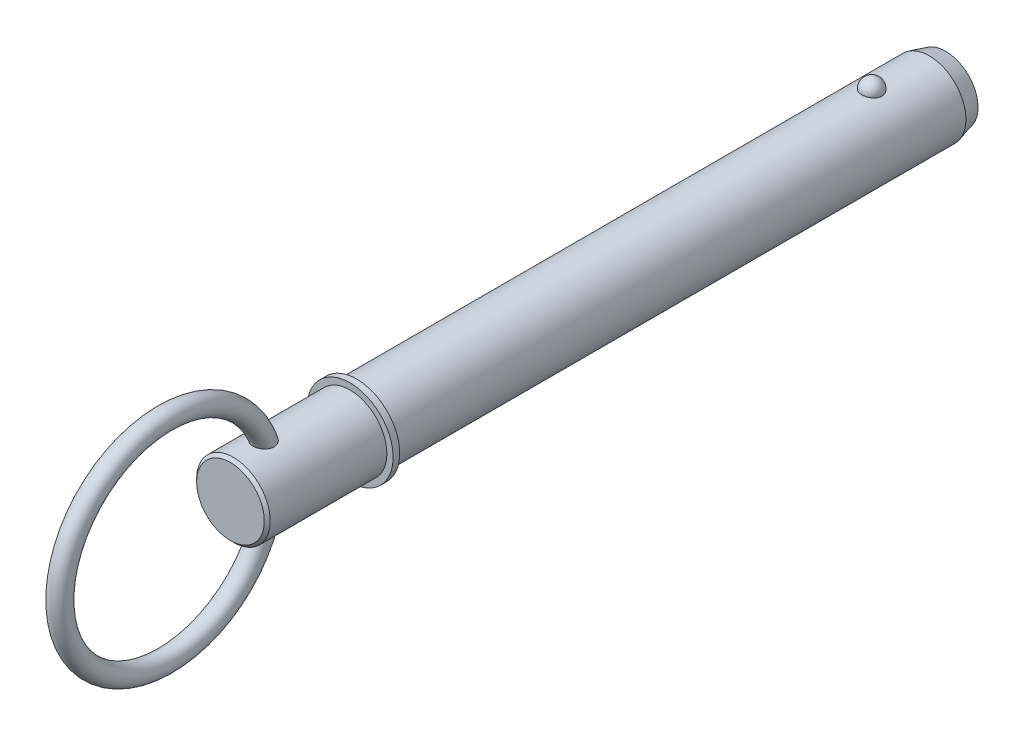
ISO-10303-21;
HEADER;
FILE_DESCRIPTION(('STEP AP214'),'2;1');
FILE_NAME('part.step','',(''),(''),'','','');
FILE_SCHEMA(('AUTOMOTIVE_DESIGN { 1 0 10303 214 1 1 1 1 }'));
ENDSEC;
DATA;
#1=APPLICATION_CONTEXT('core data for automotive mechanical design processes');
#2=APPLICATION_PROTOCOL_DEFINITION('international standard','automotive_design',2000,#1);
#3=PRODUCT_CONTEXT('',#1,'mechanical');
#4=PRODUCT('Part','Part','',(#3));
#5=PRODUCT_RELATED_PRODUCT_CATEGORY('part','',(#4));
#6=PRODUCT_DEFINITION_FORMATION('','',#4);
#7=PRODUCT_DEFINITION_CONTEXT('part definition',#1,'design');
#8=PRODUCT_DEFINITION('design','',#6,#7);
#9=PRODUCT_DEFINITION_SHAPE('','',#8);
#10=(LENGTH_UNIT() NAMED_UNIT(*) SI_UNIT(.MILLI.,.METRE.));
#11=(NAMED_UNIT(*) PLANE_ANGLE_UNIT() SI_UNIT($,.RADIAN.));
#12=(NAMED_UNIT(*) SI_UNIT($,.STERADIAN.) SOLID_ANGLE_UNIT());
#13=UNCERTAINTY_MEASURE_WITH_UNIT(LENGTH_MEASURE(1.E-05),#10,'distance_accuracy_value','');
#14=(GEOMETRIC_REPRESENTATION_CONTEXT(3) GLOBAL_UNCERTAINTY_ASSIGNED_CONTEXT((#13)) GLOBAL_UNIT_ASSIGNED_CONTEXT((#10,
#11,#12)) REPRESENTATION_CONTEXT('',''));
#15=CARTESIAN_POINT('',(0.,0.,0.));
#16=DIRECTION('',(0.,0.,1.));
#17=DIRECTION('',(1.,0.,0.));
#18=AXIS2_PLACEMENT_3D('',#15,#16,#17);
#19=CARTESIAN_POINT('',(0.,0.,152.4));
#20=DIRECTION('',(0.,0.,-1.));
#21=DIRECTION('',(-1.,0.,0.));
#22=AXIS2_PLACEMENT_3D('',#19,#20,#21);
#23=CYLINDRICAL_SURFACE('',#22,11.115);
#24=CARTESIAN_POINT('',(3.04058343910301,10.6910278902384,-3.07));
#25=CARTESIAN_POINT('',(3.04058039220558,10.6910304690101,-2.89837124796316));
#26=CARTESIAN_POINT('',(3.02657193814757,10.6950430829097,-2.72670368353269));
#27=CARTESIAN_POINT('',(2.97087341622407,10.7106465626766,-2.38822964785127));
#28=CARTESIAN_POINT('',(2.92917240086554,10.7222404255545,-2.22142512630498));
#29=CARTESIAN_POINT('',(2.81915317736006,10.751689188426,-1.89750816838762));
#30=CARTESIAN_POINT('',(2.75084669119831,10.7695413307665,-1.7403914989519));
#31=CARTESIAN_POINT('',(2.58932284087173,10.809510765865,-1.44013959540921));
#32=CARTESIAN_POINT('',(2.49610617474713,10.8316279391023,-1.29700396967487));
#33=CARTESIAN_POINT('',(2.28659317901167,10.877786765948,-1.02797591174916));
#34=CARTESIAN_POINT('',(2.17018825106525,10.9018371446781,-0.902169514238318));
#35=CARTESIAN_POINT('',(1.91759004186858,10.9490888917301,-0.672091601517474));
#36=CARTESIAN_POINT('',(1.78139672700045,10.9722902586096,-0.56782012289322));
#37=CARTESIAN_POINT('',(1.49327884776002,11.0151925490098,-0.383992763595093));
#38=CARTESIAN_POINT('',(1.34139928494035,11.034903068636,-0.304368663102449));
#39=CARTESIAN_POINT('',(1.02584823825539,11.0686948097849,-0.171731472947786));
#40=CARTESIAN_POINT('',(0.862178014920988,11.0827766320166,-0.11871554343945));
#41=CARTESIAN_POINT('',(0.530748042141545,11.1035404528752,-0.0415304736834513));
#42=CARTESIAN_POINT('',(0.363109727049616,11.1103474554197,-0.0168734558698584));
#43=CARTESIAN_POINT('',(0.025932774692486,11.1162480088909,0.0045348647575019));
#44=CARTESIAN_POINT('',(-0.143605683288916,11.1153422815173,0.0012887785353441));
#45=CARTESIAN_POINT('',(-0.477280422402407,11.1059854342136,-0.0327676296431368));
#46=CARTESIAN_POINT('',(-0.641459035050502,11.0976393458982,-0.0631942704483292));
#47=CARTESIAN_POINT('',(-0.962236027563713,11.0744390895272,-0.150220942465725));
#48=CARTESIAN_POINT('',(-1.11883427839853,11.0595848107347,-0.206821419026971));
#49=CARTESIAN_POINT('',(-1.4210461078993,11.0248420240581,-0.345028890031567));
#50=CARTESIAN_POINT('',(-1.56659244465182,11.0049254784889,-0.426775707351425));
#51=CARTESIAN_POINT('',(-1.8418931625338,10.9622119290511,-0.612956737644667));
#52=CARTESIAN_POINT('',(-1.97164597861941,10.9394146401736,-0.717393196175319));
#53=CARTESIAN_POINT('',(-2.21432263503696,10.8929139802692,-0.94833213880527));
#54=CARTESIAN_POINT('',(-2.32688909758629,10.8692016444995,-1.07520847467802));
#55=CARTESIAN_POINT('',(-2.52940007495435,10.8238699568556,-1.34622145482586));
#56=CARTESIAN_POINT('',(-2.6193430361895,10.8022507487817,-1.4903592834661));
#57=CARTESIAN_POINT('',(-2.77523958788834,10.7632629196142,-1.7936750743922));
#58=CARTESIAN_POINT('',(-2.8409151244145,10.7459442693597,-1.95300253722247));
#59=CARTESIAN_POINT('',(-2.94519180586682,10.7178360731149,-2.28083009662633));
#60=CARTESIAN_POINT('',(-2.98379371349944,10.707046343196,-2.44932993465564));
#61=CARTESIAN_POINT('',(-3.03284665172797,10.6932559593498,-2.78998091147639));
#62=CARTESIAN_POINT('',(-3.04341313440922,10.6902233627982,-2.96211412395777));
#63=CARTESIAN_POINT('',(-3.03646037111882,10.6922002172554,-3.305762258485));
#64=CARTESIAN_POINT('',(-3.0189418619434,10.6972094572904,-3.47727719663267));
#65=CARTESIAN_POINT('',(-2.95641582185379,10.7146564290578,-3.81396465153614));
#66=CARTESIAN_POINT('',(-2.91154117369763,10.7270582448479,-3.97916375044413));
#67=CARTESIAN_POINT('',(-2.79553341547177,10.7578713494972,-4.29947360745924));
#68=CARTESIAN_POINT('',(-2.72439927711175,10.7762828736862,-4.45458397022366));
#69=CARTESIAN_POINT('',(-2.55718900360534,10.8171819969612,-4.75123550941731));
#70=CARTESIAN_POINT('',(-2.46098224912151,10.8396907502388,-4.89270014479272));
#71=CARTESIAN_POINT('',(-2.24623042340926,10.8862165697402,-5.15724095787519));
#72=CARTESIAN_POINT('',(-2.12768452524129,10.9102336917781,-5.28031645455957));
#73=CARTESIAN_POINT('',(-1.87085107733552,10.9571990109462,-5.5050961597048));
#74=CARTESIAN_POINT('',(-1.73249451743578,10.9801430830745,-5.60672245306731));
#75=CARTESIAN_POINT('',(-1.44010079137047,11.0223008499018,-5.78517789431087));
#76=CARTESIAN_POINT('',(-1.28606470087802,11.0415148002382,-5.86200874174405));
#77=CARTESIAN_POINT('',(-0.968615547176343,11.0738491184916,-5.98788441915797));
#78=CARTESIAN_POINT('',(-0.805339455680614,11.0870408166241,-6.03725610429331));
#79=CARTESIAN_POINT('',(-0.47244987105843,11.1062048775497,-6.10820004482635));
#80=CARTESIAN_POINT('',(-0.302837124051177,11.11217808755,-6.1297755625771));
#81=CARTESIAN_POINT('',(0.0345765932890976,11.1162034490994,-6.14436196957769));
#82=CARTESIAN_POINT('',(0.202353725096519,11.1143988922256,-6.13788957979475));
#83=CARTESIAN_POINT('',(0.534364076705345,11.103390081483,-6.09773981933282));
#84=CARTESIAN_POINT('',(0.698597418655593,11.094186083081,-6.06406338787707));
#85=CARTESIAN_POINT('',(1.01830314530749,11.0694136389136,-5.97063285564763));
#86=CARTESIAN_POINT('',(1.17380497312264,11.0538682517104,-5.91097318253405));
#87=CARTESIAN_POINT('',(1.472484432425,11.0180608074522,-5.76723645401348));
#88=CARTESIAN_POINT('',(1.6156613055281,10.9977984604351,-5.68315789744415));
#89=CARTESIAN_POINT('',(1.88801614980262,10.9543574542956,-5.49138807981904));
#90=CARTESIAN_POINT('',(2.01695079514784,10.9311394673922,-5.38336024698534));
#91=CARTESIAN_POINT('',(2.25501495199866,10.8845248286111,-5.14733839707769));
#92=CARTESIAN_POINT('',(2.36414099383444,10.8611281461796,-5.01934088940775));
#93=CARTESIAN_POINT('',(2.56152595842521,10.8162958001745,-4.74447932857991));
#94=CARTESIAN_POINT('',(2.64940088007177,10.7948999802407,-4.59733288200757));
#95=CARTESIAN_POINT('',(2.79961494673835,10.7569242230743,-4.29001203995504));
#96=CARTESIAN_POINT('',(2.86196390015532,10.7403424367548,-4.12984267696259));
#97=CARTESIAN_POINT('',(2.95377333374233,10.715429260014,-3.820623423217));
#98=CARTESIAN_POINT('',(2.98627018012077,10.7063495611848,-3.6725268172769));
#99=CARTESIAN_POINT('',(3.02967634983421,10.6941478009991,-3.37296350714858));
#100=CARTESIAN_POINT('',(3.04058612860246,10.6910256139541,-3.2214968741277));
#101=CARTESIAN_POINT('',(3.04058343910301,10.6910278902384,-3.07));
#102=B_SPLINE_CURVE_WITH_KNOTS('',3,(#24,#25,#26,#27,#28,#29,#30,#31,#32,#33,#34,#35,#36,#37,
#38,#39,#40,#41,#42,#43,#44,#45,#46,#47,#48,#49,#50,#51,#52,#53,#54,#55,#56,#57,#58,#59,#60,#61,
#62,#63,#64,#65,#66,#67,#68,#69,#70,#71,#72,#73,#74,#75,#76,#77,#78,#79,#80,#81,#82,#83,#84,#85,
#86,#87,#88,#89,#90,#91,#92,#93,#94,#95,#96,#97,#98,#99,#100,#101),.UNSPECIFIED.,.T.,.F.,(4,2,2,
2,2,2,2,2,2,2,2,2,2,2,2,2,2,2,2,2,2,2,2,2,2,2,2,2,2,2,2,2,2,2,2,2,2,2,4),(0.,0.514341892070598,
1.02888723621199,1.54320613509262,2.0575106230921,2.57428293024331,3.09105611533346,
3.60638589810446,4.1216606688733,4.62793159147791,5.13415514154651,5.63334381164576,
6.13254097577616,6.63456562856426,7.13663998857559,7.64804063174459,8.15947638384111,
8.67660265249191,9.19371435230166,9.70869321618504,10.223658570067,10.7361421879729,
11.2486458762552,11.7638748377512,12.2791228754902,12.7962115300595,13.3132647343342,
13.8240238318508,14.3347229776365,14.8360540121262,15.3373677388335,15.8368746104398,
16.3364121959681,16.8434736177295,17.3506237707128,17.8663484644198,18.3818748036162,
18.8358944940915,19.2899046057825),.UNSPECIFIED.);
#103=CARTESIAN_POINT('',(3.04058343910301,10.6910278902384,-3.07));
#104=VERTEX_POINT('',#103);
#105=EDGE_CURVE('E100',#104,#104,#102,.T.);
#106=ORIENTED_EDGE('',*,*,#105,.T.);
#107=EDGE_LOOP('',(#106));
#108=FACE_BOUND('',#107,.T.);
#109=CARTESIAN_POINT('',(0.,0.,-20.4000000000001));
#110=DIRECTION('',(0.,0.,-1.));
#111=DIRECTION('',(-1.,0.,0.));
#112=AXIS2_PLACEMENT_3D('',#109,#110,#111);
#113=CIRCLE('',#112,11.115);
#114=CARTESIAN_POINT('',(-11.115,0.,-20.4000000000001));
#115=VERTEX_POINT('',#114);
#116=EDGE_CURVE('E108',#115,#115,#113,.F.);
#117=ORIENTED_EDGE('',*,*,#116,.T.);
#118=EDGE_LOOP('',(#117));
#119=FACE_BOUND('',#118,.T.);
#120=CARTESIAN_POINT('',(0.,0.,152.4));
#121=DIRECTION('',(0.,0.,1.));
#122=DIRECTION('',(1.,0.,0.));
#123=AXIS2_PLACEMENT_3D('',#120,#121,#122);
#124=CIRCLE('',#123,11.115);
#125=CARTESIAN_POINT('',(11.115,0.,152.4));
#126=VERTEX_POINT('',#125);
#127=EDGE_CURVE('E106',#126,#126,#124,.T.);
#128=ORIENTED_EDGE('',*,*,#127,.F.);
#129=EDGE_LOOP('',(#128));
#130=FACE_BOUND('',#129,.T.);
#131=ADVANCED_FACE('F39',(#108,#119,#130),#23,.T.);
#132=CARTESIAN_POINT('',(0.,0.,-25.4));
#133=DIRECTION('',(0.,0.,-1.));
#134=DIRECTION('',(-1.,0.,0.));
#135=AXIS2_PLACEMENT_3D('',#132,#133,#134);
#136=PLANE('',#135);
#137=CARTESIAN_POINT('',(0.,0.,-25.4));
#138=DIRECTION('',(0.,0.,-1.));
#139=DIRECTION('',(-1.,0.,0.));
#140=AXIS2_PLACEMENT_3D('',#137,#138,#139);
#141=CIRCLE('',#140,9.77525403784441);
#142=CARTESIAN_POINT('',(-9.77525403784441,0.,-25.4));
#143=VERTEX_POINT('',#142);
#144=EDGE_CURVE('E140',#143,#143,#141,.T.);
#145=ORIENTED_EDGE('',*,*,#144,.T.);
#146=EDGE_LOOP('',(#145));
#147=FACE_BOUND('',#146,.T.);
#148=ADVANCED_FACE('F86',(#147),#136,.T.);
#149=CARTESIAN_POINT('',(0.,0.,-25.4));
#150=DIRECTION('',(0.,0.,1.));
#151=DIRECTION('',(1.,0.,0.));
#152=AXIS2_PLACEMENT_3D('',#149,#150,#151);
#153=CONICAL_SURFACE('',#152,9.7752540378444,0.261799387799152);
#154=ORIENTED_EDGE('',*,*,#116,.F.);
#155=EDGE_LOOP('',(#154));
#156=FACE_BOUND('',#155,.T.);
#157=ORIENTED_EDGE('',*,*,#144,.F.);
#158=EDGE_LOOP('',(#157));
#159=FACE_BOUND('',#158,.T.);
#160=ADVANCED_FACE('F92',(#156,#159),#153,.T.);
#161=CARTESIAN_POINT('',(0.,11.115,-3.07));
#162=DIRECTION('',(0.,1.,0.));
#163=DIRECTION('',(0.,0.,1.));
#164=AXIS2_PLACEMENT_3D('',#161,#162,#163);
#165=SPHERICAL_SURFACE('',#164,3.07);
#166=ORIENTED_EDGE('',*,*,#105,.F.);
#167=EDGE_LOOP('',(#166));
#168=FACE_BOUND('',#167,.T.);
#169=ADVANCED_FACE('F111',(#168),#165,.T.);
#170=CARTESIAN_POINT('',(0.,0.,152.4));
#171=DIRECTION('',(0.,0.,-1.));
#172=DIRECTION('',(-1.,0.,0.));
#173=AXIS2_PLACEMENT_3D('',#170,#171,#172);
#174=PLANE('',#173);
#175=ORIENTED_EDGE('',*,*,#127,.T.);
#176=EDGE_LOOP('',(#175));
#177=FACE_BOUND('',#176,.T.);
#178=CARTESIAN_POINT('',(0.,0.,152.4));
#179=DIRECTION('',(0.,0.,-1.));
#180=DIRECTION('',(-1.,0.,0.));
#181=AXIS2_PLACEMENT_3D('',#178,#179,#180);
#182=CIRCLE('',#181,13.);
#183=CARTESIAN_POINT('',(-13.,0.,152.4));
#184=VERTEX_POINT('',#183);
#185=EDGE_CURVE('E107',#184,#184,#182,.T.);
#186=ORIENTED_EDGE('',*,*,#185,.T.);
#187=EDGE_LOOP('',(#186));
#188=FACE_BOUND('',#187,.T.);
#189=ADVANCED_FACE('F115',(#177,#188),#174,.T.);
#190=CARTESIAN_POINT('',(0.,0.,33.7287874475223));
#191=DIRECTION('',(0.,0.,-1.));
#192=DIRECTION('',(-1.,0.,0.));
#193=AXIS2_PLACEMENT_3D('',#190,#191,#192);
#194=CYLINDRICAL_SURFACE('',#193,13.);
#195=CARTESIAN_POINT('',(0.,0.,154.4));
#196=DIRECTION('',(0.,0.,-1.));
#197=DIRECTION('',(-1.,0.,0.));
#198=AXIS2_PLACEMENT_3D('',#195,#196,#197);
#199=CIRCLE('',#198,13.);
#200=CARTESIAN_POINT('',(-13.,0.,154.4));
#201=VERTEX_POINT('',#200);
#202=EDGE_CURVE('E132',#201,#201,#199,.T.);
#203=ORIENTED_EDGE('',*,*,#202,.T.);
#204=EDGE_LOOP('',(#203));
#205=FACE_BOUND('',#204,.T.);
#206=ORIENTED_EDGE('',*,*,#185,.F.);
#207=EDGE_LOOP('',(#206));
#208=FACE_BOUND('',#207,.T.);
#209=ADVANCED_FACE('F119',(#205,#208),#194,.T.);
#210=CARTESIAN_POINT('',(0.,13.,154.4));
#211=DIRECTION('',(0.,0.,1.));
#212=DIRECTION('',(1.,0.,0.));
#213=AXIS2_PLACEMENT_3D('',#210,#211,#212);
#214=PLANE('',#213);
#215=CARTESIAN_POINT('',(0.,0.,154.4));
#216=DIRECTION('',(0.,0.,1.));
#217=DIRECTION('',(1.,0.,0.));
#218=AXIS2_PLACEMENT_3D('',#215,#216,#217);
#219=CIRCLE('',#218,11.115);
#220=CARTESIAN_POINT('',(11.115,0.,154.4));
#221=VERTEX_POINT('',#220);
#222=EDGE_CURVE('E110',#221,#221,#219,.T.);
#223=ORIENTED_EDGE('',*,*,#222,.F.);
#224=EDGE_LOOP('',(#223));
#225=FACE_BOUND('',#224,.T.);
#226=ORIENTED_EDGE('',*,*,#202,.F.);
#227=EDGE_LOOP('',(#226));
#228=FACE_BOUND('',#227,.T.);
#229=ADVANCED_FACE('F83',(#225,#228),#214,.T.);
#230=CARTESIAN_POINT('',(0.,0.,190.5));
#231=DIRECTION('',(0.,0.,-1.));
#232=DIRECTION('',(-1.,0.,0.));
#233=AXIS2_PLACEMENT_3D('',#230,#231,#232);
#234=CYLINDRICAL_SURFACE('',#233,11.115);
#235=CARTESIAN_POINT('',(-1.22435852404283,-11.0473603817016,177.578419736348));
#236=CARTESIAN_POINT('',(-1.07078016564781,-11.0643805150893,177.511699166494));
#237=CARTESIAN_POINT('',(-0.911372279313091,-11.0787777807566,177.457745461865));
#238=CARTESIAN_POINT('',(-0.58545152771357,-11.1007717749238,177.376552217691));
#239=CARTESIAN_POINT('',(-0.418938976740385,-11.1083688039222,177.349311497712));
#240=CARTESIAN_POINT('',(-0.0835394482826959,-11.1159515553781,177.322121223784));
#241=CARTESIAN_POINT('',(0.0853474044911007,-11.1159376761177,177.322170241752));
#242=CARTESIAN_POINT('',(0.420723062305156,-11.1083011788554,177.349554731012));
#243=CARTESIAN_POINT('',(0.587211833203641,-11.1006784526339,177.376890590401));
#244=CARTESIAN_POINT('',(0.913189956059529,-11.0786293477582,177.45829957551));
#245=CARTESIAN_POINT('',(1.07267378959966,-11.0641977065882,177.512393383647));
#246=CARTESIAN_POINT('',(1.37994044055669,-11.0300907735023,177.646140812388));
#247=CARTESIAN_POINT('',(1.52772335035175,-11.0104155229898,177.725794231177));
#248=CARTESIAN_POINT('',(1.80679367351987,-10.9680716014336,177.908467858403));
#249=CARTESIAN_POINT('',(1.93814041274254,-10.945414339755,178.011400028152));
#250=CARTESIAN_POINT('',(2.18117403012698,-10.8995884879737,178.238212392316));
#251=CARTESIAN_POINT('',(2.29286356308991,-10.8764199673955,178.362089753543));
#252=CARTESIAN_POINT('',(2.49238969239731,-10.8324319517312,178.625992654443));
#253=CARTESIAN_POINT('',(2.58046870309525,-10.8115899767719,178.765831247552));
#254=CARTESIAN_POINT('',(2.73218762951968,-10.7742522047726,179.058691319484));
#255=CARTESIAN_POINT('',(2.7958294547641,-10.757756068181,179.211711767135));
#256=CARTESIAN_POINT('',(2.89767977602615,-10.7307723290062,179.5266092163));
#257=CARTESIAN_POINT('',(2.93586554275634,-10.7202900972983,179.688493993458));
#258=CARTESIAN_POINT('',(2.98678800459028,-10.7062139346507,180.016480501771));
#259=CARTESIAN_POINT('',(2.99951894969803,-10.7026215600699,180.182583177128));
#260=CARTESIAN_POINT('',(3.0004780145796,-10.7023530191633,180.523227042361));
#261=CARTESIAN_POINT('',(2.98743421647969,-10.7060358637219,180.697770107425));
#262=CARTESIAN_POINT('',(2.93592917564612,-10.7202719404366,181.042750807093));
#263=CARTESIAN_POINT('',(2.8974582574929,-10.7308277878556,181.213186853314));
#264=CARTESIAN_POINT('',(2.79180512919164,-10.7588257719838,181.563114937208));
#265=CARTESIAN_POINT('',(2.72213928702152,-10.776850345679,181.741811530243));
#266=CARTESIAN_POINT('',(2.5561284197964,-10.8174264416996,182.085974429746));
#267=CARTESIAN_POINT('',(2.4597569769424,-10.8399824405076,182.251427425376));
#268=CARTESIAN_POINT('',(2.23434632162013,-10.8887625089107,182.575672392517));
#269=CARTESIAN_POINT('',(2.10349593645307,-10.9151327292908,182.733192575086));
#270=CARTESIAN_POINT('',(1.81505097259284,-10.96677510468,183.021668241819));
#271=CARTESIAN_POINT('',(1.65749731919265,-10.9920488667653,183.15266371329));
#272=CARTESIAN_POINT('',(1.36197799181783,-11.0319737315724,183.351313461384));
#273=CARTESIAN_POINT('',(1.22927684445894,-11.0476896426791,183.42660092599));
#274=CARTESIAN_POINT('',(0.952979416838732,-11.0749380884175,183.554574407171));
#275=CARTESIAN_POINT('',(0.809393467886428,-11.0864745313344,183.60728154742));
#276=CARTESIAN_POINT('',(0.513954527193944,-11.1041011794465,183.687058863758));
#277=CARTESIAN_POINT('',(0.362058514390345,-11.1101594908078,183.713978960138));
#278=CARTESIAN_POINT('',(0.0557792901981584,-11.1159132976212,183.739559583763));
#279=CARTESIAN_POINT('',(-0.0986030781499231,-11.1156109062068,183.738229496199));
#280=CARTESIAN_POINT('',(-0.38976828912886,-11.1090283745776,183.708935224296));
#281=CARTESIAN_POINT('',(-0.526830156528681,-11.1033186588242,183.683512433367));
#282=CARTESIAN_POINT('',(-0.794878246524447,-11.0873547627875,183.611270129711));
#283=CARTESIAN_POINT('',(-0.925863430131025,-11.0770998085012,183.564446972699));
#284=CARTESIAN_POINT('',(-1.18354406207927,-11.0525934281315,183.449843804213));
#285=CARTESIAN_POINT('',(-1.30991621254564,-11.0382116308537,183.381371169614));
#286=CARTESIAN_POINT('',(-1.55122352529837,-11.0068962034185,183.227131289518));
#287=CARTESIAN_POINT('',(-1.66615377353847,-10.9899614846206,183.141356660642));
#288=CARTESIAN_POINT('',(-1.90024050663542,-10.9520991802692,182.94087205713));
#289=CARTESIAN_POINT('',(-2.01728342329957,-10.9309598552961,182.823737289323));
#290=CARTESIAN_POINT('',(-2.23333659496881,-10.8888735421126,182.573839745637));
#291=CARTESIAN_POINT('',(-2.33233396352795,-10.8679267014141,182.441065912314));
#292=CARTESIAN_POINT('',(-2.52607041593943,-10.8246766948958,182.140000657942));
#293=CARTESIAN_POINT('',(-2.61741570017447,-10.8027194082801,181.969462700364));
#294=CARTESIAN_POINT('',(-2.77251687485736,-10.7639568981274,181.615671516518));
#295=CARTESIAN_POINT('',(-2.83625783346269,-10.7471544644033,181.432411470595));
#296=CARTESIAN_POINT('',(-2.93668505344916,-10.7201706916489,181.046624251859));
#297=CARTESIAN_POINT('',(-2.97161961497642,-10.7104219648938,180.843594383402));
#298=CARTESIAN_POINT('',(-2.99683495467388,-10.7033740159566,180.536874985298));
#299=CARTESIAN_POINT('',(-3.00070536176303,-10.7022882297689,180.434234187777));
#300=CARTESIAN_POINT('',(-2.99908594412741,-10.7027439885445,180.229049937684));
#301=CARTESIAN_POINT('',(-2.99360154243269,-10.7042840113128,180.126506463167));
#302=CARTESIAN_POINT('',(-2.97382504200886,-10.7097936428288,179.930330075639));
#303=CARTESIAN_POINT('',(-2.9602439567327,-10.7135669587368,179.836619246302));
#304=CARTESIAN_POINT('',(-2.92480741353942,-10.723295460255,179.650932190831));
#305=CARTESIAN_POINT('',(-2.90295619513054,-10.7292495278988,179.55895510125));
#306=CARTESIAN_POINT('',(-2.85097003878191,-10.7431800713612,179.377547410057));
#307=CARTESIAN_POINT('',(-2.82083748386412,-10.7511559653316,179.288116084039));
#308=CARTESIAN_POINT('',(-2.75241691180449,-10.7688750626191,179.11264532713));
#309=CARTESIAN_POINT('',(-2.71412954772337,-10.7786181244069,179.02660562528));
#310=CARTESIAN_POINT('',(-2.59550576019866,-10.807996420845,178.791055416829));
#311=CARTESIAN_POINT('',(-2.50612224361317,-10.8292837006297,178.646173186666));
#312=CARTESIAN_POINT('',(-2.30366035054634,-10.8741467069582,178.374571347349));
#313=CARTESIAN_POINT('',(-2.19058370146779,-10.8977222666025,178.247850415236));
#314=CARTESIAN_POINT('',(-1.94442412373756,-10.9443154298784,178.016462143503));
#315=CARTESIAN_POINT('',(-1.81141354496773,-10.967334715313,177.91171820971));
#316=CARTESIAN_POINT('',(-1.52904284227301,-11.0102504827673,177.726435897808));
#317=CARTESIAN_POINT('',(-1.37968206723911,-11.0301468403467,177.645898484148));
#318=CARTESIAN_POINT('',(-1.22435852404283,-11.0473603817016,177.578419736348));
#319=B_SPLINE_CURVE_WITH_KNOTS('',3,(#235,#236,#237,#238,#239,#240,#241,#242,#243,#244,#245,
#246,#247,#248,#249,#250,#251,#252,#253,#254,#255,#256,#257,#258,#259,#260,#261,#262,#263,#264,
#265,#266,#267,#268,#269,#270,#271,#272,#273,#274,#275,#276,#277,#278,#279,#280,#281,#282,#283,
#284,#285,#286,#287,#288,#289,#290,#291,#292,#293,#294,#295,#296,#297,#298,#299,#300,#301,#302,
#303,#304,#305,#306,#307,#308,#309,#310,#311,#312,#313,#314,#315,#316,#317,#318),.UNSPECIFIED.,
.T.,.F.,(4,2,2,2,2,2,2,2,2,2,2,2,2,2,2,2,2,2,2,2,2,2,2,2,2,2,2,2,2,2,2,2,2,2,2,2,2,2,2,2,2,4),
(0.,0.504317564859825,1.00861284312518,1.51288173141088,2.01715779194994,2.52182424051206,
3.02648670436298,3.52927157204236,4.03198848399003,4.5293269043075,5.02662645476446,
5.52436944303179,6.02222485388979,6.54526169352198,7.0684976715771,7.64398785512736,
8.22004937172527,8.83633461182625,9.45168373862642,9.90997173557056,10.3678300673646,
10.8283372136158,11.2886913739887,11.7053264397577,12.1220324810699,12.5537129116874,
12.9855779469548,13.4844842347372,13.9837454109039,14.5653303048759,15.1472294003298,
15.762338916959,16.0701226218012,16.3777279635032,16.6616380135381,16.9454027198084,
17.229085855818,17.5127462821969,18.0246262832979,18.5364689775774,19.0464970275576,
19.556545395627),.UNSPECIFIED.);
#320=CARTESIAN_POINT('',(-1.22435852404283,-11.0473603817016,177.578419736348));
#321=VERTEX_POINT('',#320);
#322=EDGE_CURVE('E10',#321,#321,#319,.T.);
#323=ORIENTED_EDGE('',*,*,#322,.F.);
#324=EDGE_LOOP('',(#323));
#325=FACE_BOUND('',#324,.T.);
#326=CARTESIAN_POINT('',(-1.22435852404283,11.0473603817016,177.578419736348));
#327=CARTESIAN_POINT('',(-1.37630771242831,11.0305212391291,177.644431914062));
#328=CARTESIAN_POINT('',(-1.52254325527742,11.0111158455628,177.722938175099));
#329=CARTESIAN_POINT('',(-1.79945383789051,10.9692671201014,177.90315338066));
#330=CARTESIAN_POINT('',(-1.93013010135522,10.9468240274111,178.004860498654));
#331=CARTESIAN_POINT('',(-2.17227655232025,10.9013603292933,178.229035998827));
#332=CARTESIAN_POINT('',(-2.28373752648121,10.8783394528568,178.351514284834));
#333=CARTESIAN_POINT('',(-2.48427458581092,10.8343057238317,178.613895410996));
#334=CARTESIAN_POINT('',(-2.57335330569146,10.8132926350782,178.753796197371));
#335=CARTESIAN_POINT('',(-2.7264007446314,10.7757209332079,179.045964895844));
#336=CARTESIAN_POINT('',(-2.79054231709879,10.7591319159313,179.19813851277));
#337=CARTESIAN_POINT('',(-2.89354234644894,10.7318913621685,179.511286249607));
#338=CARTESIAN_POINT('',(-2.93239912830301,10.7212402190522,179.672260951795));
#339=CARTESIAN_POINT('',(-2.9854043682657,10.7066038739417,180.001955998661));
#340=CARTESIAN_POINT('',(-2.9990165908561,10.7027634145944,180.170768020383));
#341=CARTESIAN_POINT('',(-3.00088147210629,10.7022388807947,180.508508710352));
#342=CARTESIAN_POINT('',(-2.98912652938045,10.7055569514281,180.677437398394));
#343=CARTESIAN_POINT('',(-2.93985175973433,10.7191979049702,181.024856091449));
#344=CARTESIAN_POINT('',(-2.90036626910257,10.7300544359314,181.203044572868));
#345=CARTESIAN_POINT('',(-2.79555002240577,10.7578360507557,181.551215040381));
#346=CARTESIAN_POINT('',(-2.73019988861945,10.774765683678,181.721190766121));
#347=CARTESIAN_POINT('',(-2.56762574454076,10.8147227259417,182.065784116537));
#348=CARTESIAN_POINT('',(-2.46786230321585,10.838191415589,182.239157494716));
#349=CARTESIAN_POINT('',(-2.24100420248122,10.8873575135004,182.566686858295));
#350=CARTESIAN_POINT('',(-2.11391925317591,10.9130541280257,182.720849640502));
#351=CARTESIAN_POINT('',(-1.85542700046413,10.9597063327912,182.982735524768));
#352=CARTESIAN_POINT('',(-1.727583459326,10.9807909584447,183.093955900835));
#353=CARTESIAN_POINT('',(-1.4548993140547,11.0202250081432,183.29412236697));
#354=CARTESIAN_POINT('',(-1.31006770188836,11.0385758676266,183.383080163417));
#355=CARTESIAN_POINT('',(-1.08171164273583,11.0625084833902,183.4963702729));
#356=CARTESIAN_POINT('',(-1.00332234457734,11.069914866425,183.530896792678));
#357=CARTESIAN_POINT('',(-0.843525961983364,11.0832350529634,183.592391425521));
#358=CARTESIAN_POINT('',(-0.762120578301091,11.0891496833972,183.619363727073));
#359=CARTESIAN_POINT('',(-0.597014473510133,11.0992628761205,183.66518193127));
#360=CARTESIAN_POINT('',(-0.513315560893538,11.1034627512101,183.684034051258));
#361=CARTESIAN_POINT('',(-0.344374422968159,11.1099851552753,183.713209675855));
#362=CARTESIAN_POINT('',(-0.259132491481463,11.1123080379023,183.723534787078));
#363=CARTESIAN_POINT('',(-0.100838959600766,11.114780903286,183.734519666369));
#364=CARTESIAN_POINT('',(-0.0278735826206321,11.1152042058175,183.736395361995));
#365=CARTESIAN_POINT('',(0.117962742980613,11.1146132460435,183.733773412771));
#366=CARTESIAN_POINT('',(0.190833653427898,11.1135985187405,183.729273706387));
#367=CARTESIAN_POINT('',(0.335842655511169,11.110161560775,183.713978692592));
#368=CARTESIAN_POINT('',(0.407981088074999,11.1077400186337,183.703186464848));
#369=CARTESIAN_POINT('',(0.551029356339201,11.1015643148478,183.675503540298));
#370=CARTESIAN_POINT('',(0.621938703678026,11.0978096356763,183.658610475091));
#371=CARTESIAN_POINT('',(0.825381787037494,11.0851145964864,183.601054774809));
#372=CARTESIAN_POINT('',(0.955713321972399,11.0745538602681,183.552705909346));
#373=CARTESIAN_POINT('',(1.20733127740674,11.0499605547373,183.437325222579));
#374=CARTESIAN_POINT('',(1.32861527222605,11.0359270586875,183.370288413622));
#375=CARTESIAN_POINT('',(1.57344360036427,11.0038352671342,183.211843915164));
#376=CARTESIAN_POINT('',(1.69572941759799,10.9855025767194,183.118551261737));
#377=CARTESIAN_POINT('',(1.92565215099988,10.9475431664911,182.915650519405));
#378=CARTESIAN_POINT('',(2.03328016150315,10.9279156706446,182.806032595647));
#379=CARTESIAN_POINT('',(2.25048911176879,10.8854412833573,182.55299112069));
#380=CARTESIAN_POINT('',(2.35710396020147,10.8626332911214,182.407010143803));
#381=CARTESIAN_POINT('',(2.54757318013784,10.8195493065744,182.100478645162));
#382=CARTESIAN_POINT('',(2.6314105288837,10.799275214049,181.939917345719));
#383=CARTESIAN_POINT('',(2.78342312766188,10.7611645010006,181.587827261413));
#384=CARTESIAN_POINT('',(2.84851472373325,10.7439117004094,181.394893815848));
#385=CARTESIAN_POINT('',(2.94562652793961,10.7177011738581,181.000130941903));
#386=CARTESIAN_POINT('',(2.97764942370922,10.7087427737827,180.79830223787));
#387=CARTESIAN_POINT('',(2.99864828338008,10.7028651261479,180.495989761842));
#388=CARTESIAN_POINT('',(3.00125529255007,10.7021342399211,180.396378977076));
#389=CARTESIAN_POINT('',(2.99763044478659,10.7031517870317,180.197345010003));
#390=CARTESIAN_POINT('',(2.99140295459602,10.704898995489,180.097921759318));
#391=CARTESIAN_POINT('',(2.9699008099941,10.710883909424,179.900179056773));
#392=CARTESIAN_POINT('',(2.95463019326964,10.7151205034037,179.801859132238));
#393=CARTESIAN_POINT('',(2.91493260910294,10.7259879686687,179.607219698));
#394=CARTESIAN_POINT('',(2.89050674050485,10.7326185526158,179.510899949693));
#395=CARTESIAN_POINT('',(2.83556656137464,10.7472556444,179.331222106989));
#396=CARTESIAN_POINT('',(2.80596337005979,10.7550439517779,179.247566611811));
#397=CARTESIAN_POINT('',(2.73953102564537,10.7721572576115,179.083300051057));
#398=CARTESIAN_POINT('',(2.70269935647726,10.7814827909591,179.002690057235));
#399=CARTESIAN_POINT('',(2.62203440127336,10.8013833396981,178.845273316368));
#400=CARTESIAN_POINT('',(2.57820565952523,10.8119575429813,178.768464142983));
#401=CARTESIAN_POINT('',(2.48382482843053,10.8340293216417,178.619223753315));
#402=CARTESIAN_POINT('',(2.43327032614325,10.8455272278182,178.546794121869));
#403=CARTESIAN_POINT('',(2.27895739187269,10.879345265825,178.345992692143));
#404=CARTESIAN_POINT('',(2.16717186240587,10.9023791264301,178.223764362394));
#405=CARTESIAN_POINT('',(1.92442677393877,10.9478318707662,178.000151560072));
#406=CARTESIAN_POINT('',(1.79346836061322,10.9702507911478,177.898765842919));
#407=CARTESIAN_POINT('',(1.51657151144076,11.0119360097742,177.719564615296));
#408=CARTESIAN_POINT('',(1.37069187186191,11.0312139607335,177.641661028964));
#409=CARTESIAN_POINT('',(1.06764402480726,11.0646548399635,177.510680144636));
#410=CARTESIAN_POINT('',(0.910475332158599,11.0788175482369,177.457603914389));
#411=CARTESIAN_POINT('',(0.587492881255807,11.1006548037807,177.37697871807));
#412=CARTESIAN_POINT('',(0.421604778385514,11.1082585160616,177.349708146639));
#413=CARTESIAN_POINT('',(0.0874262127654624,11.1159127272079,177.322259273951));
#414=CARTESIAN_POINT('',(-0.0808643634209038,11.1159628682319,177.32208225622));
#415=CARTESIAN_POINT('',(-0.416252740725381,11.1084780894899,177.348918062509));
#416=CARTESIAN_POINT('',(-0.583334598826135,11.1008914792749,177.376116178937));
#417=CARTESIAN_POINT('',(-0.910355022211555,11.0788693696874,177.457401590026));
#418=CARTESIAN_POINT('',(-1.07029370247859,11.064433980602,177.511488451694));
#419=CARTESIAN_POINT('',(-1.22435852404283,11.0473603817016,177.578419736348));
#420=B_SPLINE_CURVE_WITH_KNOTS('',3,(#326,#327,#328,#329,#330,#331,#332,#333,#334,#335,#336,
#337,#338,#339,#340,#341,#342,#343,#344,#345,#346,#347,#348,#349,#350,#351,#352,#353,#354,#355,
#356,#357,#358,#359,#360,#361,#362,#363,#364,#365,#366,#367,#368,#369,#370,#371,#372,#373,#374,
#375,#376,#377,#378,#379,#380,#381,#382,#383,#384,#385,#386,#387,#388,#389,#390,#391,#392,#393,
#394,#395,#396,#397,#398,#399,#400,#401,#402,#403,#404,#405,#406,#407,#408,#409,#410,#411,#412,
#413,#414,#415,#416,#417,#418,#419),.UNSPECIFIED.,.T.,.F.,(4,2,2,2,2,2,2,2,2,2,2,2,2,2,2,2,2,2,
2,2,2,2,2,2,2,2,2,2,2,2,2,2,2,2,2,2,2,2,2,2,2,2,2,2,2,2,4),(0.,0.498977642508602,
0.997916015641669,1.49709295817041,1.99621111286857,2.49180514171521,2.98743199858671,
3.4934712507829,3.99966216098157,4.54591839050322,5.09258465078,5.69407889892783,
6.29535972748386,6.80565832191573,7.31568801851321,7.57328514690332,7.83073916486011,
8.08799570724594,8.34520376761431,8.56389164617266,8.78265025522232,9.00130188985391,
9.22003849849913,9.63638938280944,10.0528514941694,10.5157946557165,10.9790178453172,
11.5234572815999,12.068302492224,12.6784825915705,13.2886130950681,13.5872082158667,
13.8856557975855,14.1839702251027,14.4822488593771,14.7491407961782,15.0161257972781,
15.282938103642,15.5498463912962,16.0489312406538,16.5479862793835,17.0451454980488,
17.542326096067,18.0448111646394,18.5473200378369,19.0532532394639,19.5591782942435),.UNSPECIFIED.);
#421=CARTESIAN_POINT('',(-1.22435852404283,11.0473603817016,177.578419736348));
#422=VERTEX_POINT('',#421);
#423=EDGE_CURVE('E51',#422,#422,#420,.T.);
#424=ORIENTED_EDGE('',*,*,#423,.F.);
#425=EDGE_LOOP('',(#424));
#426=FACE_BOUND('',#425,.T.);
#427=CARTESIAN_POINT('',(0.,0.,189.6));
#428=DIRECTION('',(0.,0.,-1.));
#429=DIRECTION('',(-1.,0.,0.));
#430=AXIS2_PLACEMENT_3D('',#427,#428,#429);
#431=CIRCLE('',#430,11.115);
#432=CARTESIAN_POINT('',(-11.115,0.,189.6));
#433=VERTEX_POINT('',#432);
#434=EDGE_CURVE('E62',#433,#433,#431,.T.);
#435=ORIENTED_EDGE('',*,*,#434,.T.);
#436=EDGE_LOOP('',(#435));
#437=FACE_BOUND('',#436,.T.);
#438=ORIENTED_EDGE('',*,*,#222,.T.);
#439=EDGE_LOOP('',(#438));
#440=FACE_BOUND('',#439,.T.);
#441=ADVANCED_FACE('F67',(#325,#426,#437,#440),#234,.T.);
#442=CARTESIAN_POINT('',(0.,0.,190.5));
#443=DIRECTION('',(0.,0.,-1.));
#444=DIRECTION('',(-1.,0.,0.));
#445=AXIS2_PLACEMENT_3D('',#442,#443,#444);
#446=PLANE('',#445);
#447=CARTESIAN_POINT('',(0.,0.,190.5));
#448=DIRECTION('',(0.,0.,-1.));
#449=DIRECTION('',(-1.,0.,0.));
#450=AXIS2_PLACEMENT_3D('',#447,#448,#449);
#451=CIRCLE('',#450,10.2149999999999);
#452=CARTESIAN_POINT('',(-10.2149999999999,0.,190.5));
#453=VERTEX_POINT('',#452);
#454=EDGE_CURVE('E57',#453,#453,#451,.F.);
#455=ORIENTED_EDGE('',*,*,#454,.T.);
#456=EDGE_LOOP('',(#455));
#457=FACE_BOUND('',#456,.T.);
#458=ADVANCED_FACE('F74',(#457),#446,.F.);
#459=CARTESIAN_POINT('',(0.,0.,189.6));
#460=DIRECTION('',(0.,0.,-1.));
#461=DIRECTION('',(-1.,0.,0.));
#462=AXIS2_PLACEMENT_3D('',#459,#460,#461);
#463=CONICAL_SURFACE('',#462,11.115,0.785398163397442);
#464=ORIENTED_EDGE('',*,*,#454,.F.);
#465=EDGE_LOOP('',(#464));
#466=FACE_BOUND('',#465,.T.);
#467=ORIENTED_EDGE('',*,*,#434,.F.);
#468=EDGE_LOOP('',(#467));
#469=FACE_BOUND('',#468,.T.);
#470=ADVANCED_FACE('F41',(#466,#469),#463,.T.);
#471=CARTESIAN_POINT('',(0.,0.,210.25));
#472=DIRECTION('',(1.,0.,0.));
#473=DIRECTION('',(0.,0.,-1.));
#474=AXIS2_PLACEMENT_3D('',#471,#472,#473);
#475=TOROIDAL_SURFACE('',#474,31.75,3.);
#476=ORIENTED_EDGE('',*,*,#322,.T.);
#477=EDGE_LOOP('',(#476));
#478=FACE_BOUND('',#477,.T.);
#479=ORIENTED_EDGE('',*,*,#423,.T.);
#480=EDGE_LOOP('',(#479));
#481=FACE_BOUND('',#480,.T.);
#482=ADVANCED_FACE('F71',(#478,#481),#475,.T.);
#483=CLOSED_SHELL('',(#131,#148,#160,#169,#189,#209,#229,#441,#458,#470,#482));
#484=MANIFOLD_SOLID_BREP('B2',#483);
#485=ADVANCED_BREP_SHAPE_REPRESENTATION('',(#18,#484),#14);
#486=SHAPE_DEFINITION_REPRESENTATION(#9,#485);
ENDSEC;
END-ISO-10303-21;
